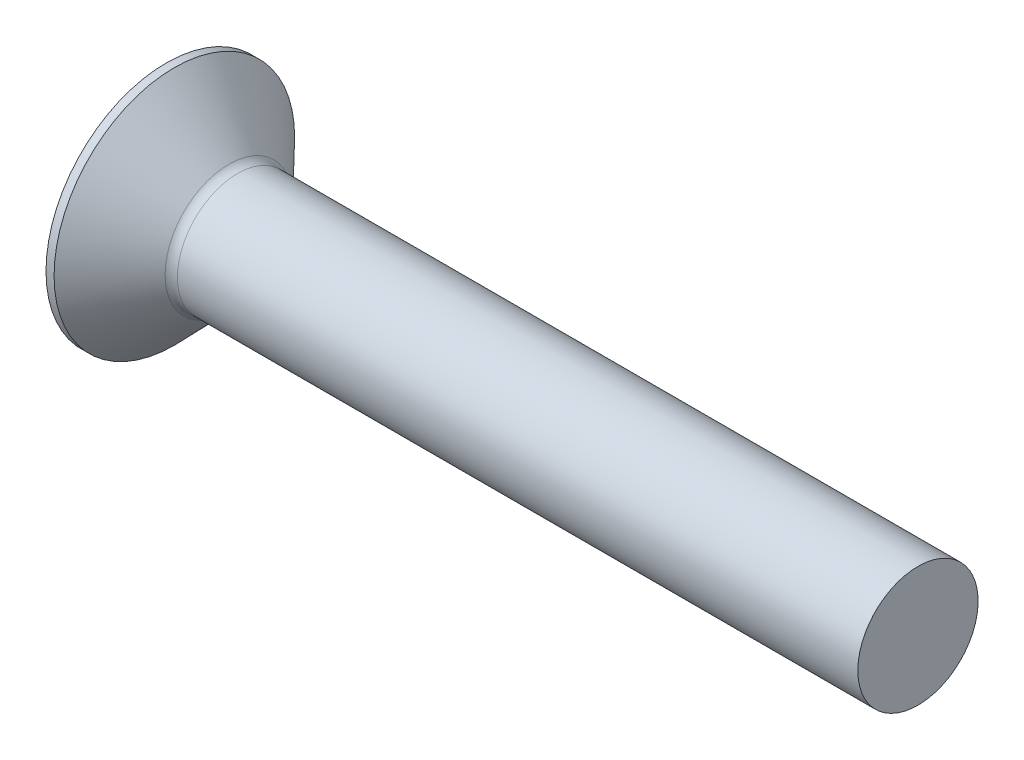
ISO-10303-21;
HEADER;
FILE_DESCRIPTION(('STEP AP214'),'2;1');
FILE_NAME('part.step','',(''),(''),'','','');
FILE_SCHEMA(('AUTOMOTIVE_DESIGN { 1 0 10303 214 1 1 1 1 }'));
ENDSEC;
DATA;
#1=APPLICATION_CONTEXT('core data for automotive mechanical design processes');
#2=APPLICATION_PROTOCOL_DEFINITION('international standard','automotive_design',2000,#1);
#3=PRODUCT_CONTEXT('',#1,'mechanical');
#4=PRODUCT('Part','Part','',(#3));
#5=PRODUCT_RELATED_PRODUCT_CATEGORY('part','',(#4));
#6=PRODUCT_DEFINITION_FORMATION('','',#4);
#7=PRODUCT_DEFINITION_CONTEXT('part definition',#1,'design');
#8=PRODUCT_DEFINITION('design','',#6,#7);
#9=PRODUCT_DEFINITION_SHAPE('','',#8);
#10=(LENGTH_UNIT() NAMED_UNIT(*) SI_UNIT(.MILLI.,.METRE.));
#11=(NAMED_UNIT(*) PLANE_ANGLE_UNIT() SI_UNIT($,.RADIAN.));
#12=(NAMED_UNIT(*) SI_UNIT($,.STERADIAN.) SOLID_ANGLE_UNIT());
#13=UNCERTAINTY_MEASURE_WITH_UNIT(LENGTH_MEASURE(1.E-05),#10,'distance_accuracy_value','');
#14=(GEOMETRIC_REPRESENTATION_CONTEXT(3) GLOBAL_UNCERTAINTY_ASSIGNED_CONTEXT((#13)) GLOBAL_UNIT_ASSIGNED_CONTEXT((#10,
#11,#12)) REPRESENTATION_CONTEXT('',''));
#15=CARTESIAN_POINT('',(0.,0.,0.));
#16=DIRECTION('',(0.,0.,1.));
#17=DIRECTION('',(1.,0.,0.));
#18=AXIS2_PLACEMENT_3D('',#15,#16,#17);
#19=CARTESIAN_POINT('',(18.6777777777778,0.,0.));
#20=DIRECTION('',(-1.,0.,0.));
#21=DIRECTION('',(0.,1.,0.));
#22=AXIS2_PLACEMENT_3D('',#19,#20,#21);
#23=SPHERICAL_SURFACE('',#22,18.6777777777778);
#24=CARTESIAN_POINT('',(1.8,0.,0.));
#25=DIRECTION('',(-1.,0.,0.));
#26=DIRECTION('',(0.,0.,1.));
#27=AXIS2_PLACEMENT_3D('',#24,#25,#26);
#28=CIRCLE('',#27,8.);
#29=CARTESIAN_POINT('',(1.8,0.,8.));
#30=VERTEX_POINT('',#29);
#31=EDGE_CURVE('E703',#30,#30,#28,.T.);
#32=ORIENTED_EDGE('',*,*,#31,.T.);
#33=EDGE_LOOP('',(#32));
#34=FACE_BOUND('',#33,.T.);
#35=CARTESIAN_POINT('',(0.115409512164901,0.,0.));
#36=DIRECTION('',(1.,0.,0.));
#37=DIRECTION('',(0.,0.,-1.));
#38=AXIS2_PLACEMENT_3D('',#35,#36,#37);
#39=CIRCLE('',#38,2.07312978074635);
#40=CARTESIAN_POINT('',(0.115409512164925,-0.945999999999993,-1.84470894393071));
#41=VERTEX_POINT('',#40);
#42=CARTESIAN_POINT('',(0.115409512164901,-1.84470894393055,-0.945999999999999));
#43=VERTEX_POINT('',#42);
#44=EDGE_CURVE('E486',#41,#43,#39,.F.);
#45=ORIENTED_EDGE('',*,*,#44,.F.);
#46=CARTESIAN_POINT('',(18.6777777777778,-0.946,0.));
#47=DIRECTION('',(0.,1.,0.));
#48=DIRECTION('',(0.,0.,1.));
#49=AXIS2_PLACEMENT_3D('',#46,#47,#48);
#50=CIRCLE('',#49,18.6538056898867);
#51=CARTESIAN_POINT('',(0.472183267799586,-0.945999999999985,-4.06457811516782));
#52=VERTEX_POINT('',#51);
#53=EDGE_CURVE('E677',#52,#41,#50,.T.);
#54=ORIENTED_EDGE('',*,*,#53,.F.);
#55=CARTESIAN_POINT('',(16.6762390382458,0.,4.01446578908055));
#56=DIRECTION('',(-0.446197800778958,0.,0.894934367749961));
#57=DIRECTION('',(0.89493436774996,0.,0.446197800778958));
#58=AXIS2_PLACEMENT_3D('',#55,#56,#57);
#59=CIRCLE('',#58,18.1311138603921);
#60=CARTESIAN_POINT('',(0.472183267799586,0.946000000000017,-4.06457811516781));
#61=VERTEX_POINT('',#60);
#62=EDGE_CURVE('E61',#61,#52,#59,.T.);
#63=ORIENTED_EDGE('',*,*,#62,.F.);
#64=CARTESIAN_POINT('',(18.6777777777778,0.945999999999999,0.));
#65=DIRECTION('',(0.,-1.,0.));
#66=DIRECTION('',(0.,0.,-1.));
#67=AXIS2_PLACEMENT_3D('',#64,#65,#66);
#68=CIRCLE('',#67,18.6538056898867);
#69=CARTESIAN_POINT('',(0.115409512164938,0.946000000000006,-1.8447089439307));
#70=VERTEX_POINT('',#69);
#71=EDGE_CURVE('E589',#70,#61,#68,.T.);
#72=ORIENTED_EDGE('',*,*,#71,.F.);
#73=CARTESIAN_POINT('',(0.115409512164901,1.84470894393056,-0.945999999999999));
#74=VERTEX_POINT('',#73);
#75=EDGE_CURVE('E733',#74,#70,#39,.F.);
#76=ORIENTED_EDGE('',*,*,#75,.F.);
#77=CARTESIAN_POINT('',(18.6777777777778,0.,-0.945999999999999));
#78=DIRECTION('',(0.,0.,1.));
#79=DIRECTION('',(1.,0.,0.));
#80=AXIS2_PLACEMENT_3D('',#77,#78,#79);
#81=CIRCLE('',#80,18.6538056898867);
#82=CARTESIAN_POINT('',(0.472183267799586,4.06457811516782,-0.945999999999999));
#83=VERTEX_POINT('',#82);
#84=EDGE_CURVE('E714',#83,#74,#81,.T.);
#85=ORIENTED_EDGE('',*,*,#84,.F.);
#86=CARTESIAN_POINT('',(16.6762390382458,-4.01446578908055,0.));
#87=DIRECTION('',(-0.446197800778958,-0.89493436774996,0.));
#88=DIRECTION('',(0.89493436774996,-0.446197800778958,0.));
#89=AXIS2_PLACEMENT_3D('',#86,#87,#88);
#90=CIRCLE('',#89,18.1311138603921);
#91=CARTESIAN_POINT('',(0.472183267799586,4.06457811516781,0.946));
#92=VERTEX_POINT('',#91);
#93=EDGE_CURVE('E711',#92,#83,#90,.T.);
#94=ORIENTED_EDGE('',*,*,#93,.F.);
#95=CARTESIAN_POINT('',(18.6777777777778,0.,0.946));
#96=DIRECTION('',(0.,0.,-1.));
#97=DIRECTION('',(0.,1.,0.));
#98=AXIS2_PLACEMENT_3D('',#95,#96,#97);
#99=CIRCLE('',#98,18.6538056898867);
#100=CARTESIAN_POINT('',(0.115409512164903,1.84470894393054,0.946));
#101=VERTEX_POINT('',#100);
#102=EDGE_CURVE('E77',#101,#92,#99,.T.);
#103=ORIENTED_EDGE('',*,*,#102,.F.);
#104=CARTESIAN_POINT('',(0.11540951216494,0.945999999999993,1.84470894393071));
#105=VERTEX_POINT('',#104);
#106=EDGE_CURVE('E485',#105,#101,#39,.F.);
#107=ORIENTED_EDGE('',*,*,#106,.F.);
#108=CARTESIAN_POINT('',(0.472183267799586,0.945999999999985,4.06457811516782));
#109=VERTEX_POINT('',#108);
#110=EDGE_CURVE('E681',#109,#105,#68,.T.);
#111=ORIENTED_EDGE('',*,*,#110,.F.);
#112=CARTESIAN_POINT('',(16.6762390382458,0.,-4.01446578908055));
#113=DIRECTION('',(-0.446197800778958,0.,-0.89493436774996));
#114=DIRECTION('',(-0.89493436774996,0.,0.446197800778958));
#115=AXIS2_PLACEMENT_3D('',#112,#113,#114);
#116=CIRCLE('',#115,18.1311138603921);
#117=CARTESIAN_POINT('',(0.472183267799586,-0.946000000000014,4.06457811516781));
#118=VERTEX_POINT('',#117);
#119=EDGE_CURVE('E673',#118,#109,#116,.T.);
#120=ORIENTED_EDGE('',*,*,#119,.F.);
#121=CARTESIAN_POINT('',(0.115409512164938,-0.946000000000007,1.8447089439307));
#122=VERTEX_POINT('',#121);
#123=EDGE_CURVE('E680',#122,#118,#50,.T.);
#124=ORIENTED_EDGE('',*,*,#123,.F.);
#125=CARTESIAN_POINT('',(0.115409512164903,-1.84470894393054,0.946));
#126=VERTEX_POINT('',#125);
#127=EDGE_CURVE('E480',#126,#122,#39,.F.);
#128=ORIENTED_EDGE('',*,*,#127,.F.);
#129=CARTESIAN_POINT('',(0.472183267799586,-4.06457811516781,0.945999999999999));
#130=VERTEX_POINT('',#129);
#131=EDGE_CURVE('E717',#130,#126,#99,.T.);
#132=ORIENTED_EDGE('',*,*,#131,.F.);
#133=CARTESIAN_POINT('',(16.6762390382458,4.01446578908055,0.));
#134=DIRECTION('',(-0.446197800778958,0.894934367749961,0.));
#135=DIRECTION('',(-0.89493436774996,-0.446197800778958,0.));
#136=AXIS2_PLACEMENT_3D('',#133,#134,#135);
#137=CIRCLE('',#136,18.1311138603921);
#138=CARTESIAN_POINT('',(0.472183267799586,-4.06457811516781,-0.946000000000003));
#139=VERTEX_POINT('',#138);
#140=EDGE_CURVE('E719',#139,#130,#137,.T.);
#141=ORIENTED_EDGE('',*,*,#140,.F.);
#142=EDGE_CURVE('E713',#43,#139,#81,.T.);
#143=ORIENTED_EDGE('',*,*,#142,.F.);
#144=EDGE_LOOP('',(#45,#54,#63,#72,#76,#85,#94,#103,#107,#111,#120,#124,#128,#132,#141,#143));
#145=FACE_BOUND('',#144,.T.);
#146=ADVANCED_FACE('F51',(#34,#145),#23,.T.);
#147=CARTESIAN_POINT('',(0.,-4.29999999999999,0.945999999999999));
#148=DIRECTION('',(0.,0.,-1.));
#149=DIRECTION('',(0.,1.,0.));
#150=AXIS2_PLACEMENT_3D('',#147,#148,#149);
#151=PLANE('',#150);
#152=ORIENTED_EDGE('',*,*,#131,.T.);
#153=CARTESIAN_POINT('',(0.0477500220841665,-1.8500244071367,0.946));
#154=CARTESIAN_POINT('',(0.693218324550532,-1.79930842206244,0.946));
#155=CARTESIAN_POINT('',(1.33865688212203,-1.74820388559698,0.946));
#156=CARTESIAN_POINT('',(2.62944221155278,-1.64487236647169,0.946));
#157=CARTESIAN_POINT('',(3.27478898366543,-1.59264538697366,0.946));
#158=CARTESIAN_POINT('',(4.13011009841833,-1.52244607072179,0.946));
#159=CARTESIAN_POINT('',(4.34013828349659,-1.50513000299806,0.946));
#160=CARTESIAN_POINT('',(4.76018035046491,-1.4703229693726,0.946));
#161=CARTESIAN_POINT('',(4.97019423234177,-1.45283200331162,0.946));
#162=CARTESIAN_POINT('',(5.1802,-1.43524392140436,0.946));
#163=B_SPLINE_CURVE_WITH_KNOTS('',3,(#153,#154,#155,#156,#157,#158,#159,#160,#161,#162),
.UNSPECIFIED.,.F.,.F.,(4,2,2,2,4),(0.,1.94237417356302,3.88474287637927,4.51696520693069,
5.14918811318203),.UNSPECIFIED.);
#164=CARTESIAN_POINT('',(5.18,-1.43526067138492,0.946));
#165=VERTEX_POINT('',#164);
#166=EDGE_CURVE('E478',#126,#165,#163,.T.);
#167=ORIENTED_EDGE('',*,*,#166,.T.);
#168=DIRECTION('',(0.,-1.,0.));
#169=VECTOR('',#168,1.);
#170=CARTESIAN_POINT('',(5.18,1.7173473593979,0.946));
#171=LINE('',#170,#169);
#172=CARTESIAN_POINT('',(5.18,-1.7173473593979,0.946));
#173=VERTEX_POINT('',#172);
#174=EDGE_CURVE('E430',#165,#173,#171,.T.);
#175=ORIENTED_EDGE('',*,*,#174,.T.);
#176=DIRECTION('',(0.89493436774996,0.446197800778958,0.));
#177=VECTOR('',#176,1.);
#178=CARTESIAN_POINT('',(0.,-4.3,0.945999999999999));
#179=LINE('',#178,#177);
#180=EDGE_CURVE('E693',#130,#173,#179,.T.);
#181=ORIENTED_EDGE('',*,*,#180,.F.);
#182=EDGE_LOOP('',(#152,#167,#175,#181));
#183=FACE_BOUND('',#182,.T.);
#184=ADVANCED_FACE('F208',(#183),#151,.T.);
#185=CARTESIAN_POINT('',(5.18,1.7173473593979,0.946));
#186=VERTEX_POINT('',#185);
#187=CARTESIAN_POINT('',(5.18,1.43526067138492,0.946));
#188=VERTEX_POINT('',#187);
#189=EDGE_CURVE('E445',#186,#188,#171,.T.);
#190=ORIENTED_EDGE('',*,*,#189,.T.);
#191=CARTESIAN_POINT('',(5.1802,1.43524392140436,0.946));
#192=CARTESIAN_POINT('',(4.6464401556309,1.47993054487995,0.946));
#193=CARTESIAN_POINT('',(4.11263086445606,1.52402131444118,0.946));
#194=CARTESIAN_POINT('',(3.04493385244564,1.61123082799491,0.946));
#195=CARTESIAN_POINT('',(2.51104613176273,1.65434957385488,0.946));
#196=CARTESIAN_POINT('',(1.65558557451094,1.72283326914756,0.946));
#197=CARTESIAN_POINT('',(1.33403186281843,1.74843790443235,0.946));
#198=CARTESIAN_POINT('',(0.690904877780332,1.79940507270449,0.946));
#199=CARTESIAN_POINT('',(0.369331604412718,1.82476760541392,0.946));
#200=CARTESIAN_POINT('',(0.0477500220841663,1.8500244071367,0.946));
#201=B_SPLINE_CURVE_WITH_KNOTS('',3,(#191,#192,#193,#194,#195,#196,#197,#198,#199,#200),
.UNSPECIFIED.,.F.,.F.,(4,2,2,2,4),(0.,1.60688056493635,3.21375804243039,4.18147254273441,
5.14918815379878),.UNSPECIFIED.);
#202=EDGE_CURVE('E740',#188,#101,#201,.T.);
#203=ORIENTED_EDGE('',*,*,#202,.T.);
#204=ORIENTED_EDGE('',*,*,#102,.T.);
#205=DIRECTION('',(0.89493436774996,-0.446197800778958,0.));
#206=VECTOR('',#205,1.);
#207=CARTESIAN_POINT('',(0.,4.3,0.946));
#208=LINE('',#207,#206);
#209=EDGE_CURVE('E691',#92,#186,#208,.T.);
#210=ORIENTED_EDGE('',*,*,#209,.T.);
#211=EDGE_LOOP('',(#190,#203,#204,#210));
#212=FACE_BOUND('',#211,.T.);
#213=ADVANCED_FACE('F213',(#212),#151,.T.);
#214=CARTESIAN_POINT('',(5.18,1.7173473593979,-0.945999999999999));
#215=DIRECTION('',(0.,0.,1.));
#216=DIRECTION('',(1.,0.,0.));
#217=AXIS2_PLACEMENT_3D('',#214,#215,#216);
#218=PLANE('',#217);
#219=DIRECTION('',(0.,1.,0.));
#220=VECTOR('',#219,1.);
#221=CARTESIAN_POINT('',(5.18,1.7173473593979,-0.945999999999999));
#222=LINE('',#221,#220);
#223=CARTESIAN_POINT('',(5.18,-1.7173473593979,-0.945999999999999));
#224=VERTEX_POINT('',#223);
#225=CARTESIAN_POINT('',(5.18,-1.43526067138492,-0.945999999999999));
#226=VERTEX_POINT('',#225);
#227=EDGE_CURVE('E627',#224,#226,#222,.T.);
#228=ORIENTED_EDGE('',*,*,#227,.T.);
#229=CARTESIAN_POINT('',(5.1802,-1.43524392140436,-0.945999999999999));
#230=CARTESIAN_POINT('',(4.6464401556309,-1.47993054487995,-0.945999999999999));
#231=CARTESIAN_POINT('',(4.11263086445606,-1.52402131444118,-0.945999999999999));
#232=CARTESIAN_POINT('',(3.04493385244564,-1.61123082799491,-0.945999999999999));
#233=CARTESIAN_POINT('',(2.51104613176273,-1.65434957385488,-0.945999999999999));
#234=CARTESIAN_POINT('',(1.65558557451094,-1.72283326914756,-0.945999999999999));
#235=CARTESIAN_POINT('',(1.33403186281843,-1.74843790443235,-0.945999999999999));
#236=CARTESIAN_POINT('',(0.690904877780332,-1.79940507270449,-0.945999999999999));
#237=CARTESIAN_POINT('',(0.369331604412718,-1.82476760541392,-0.945999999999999));
#238=CARTESIAN_POINT('',(0.0477500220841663,-1.8500244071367,-0.945999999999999));
#239=B_SPLINE_CURVE_WITH_KNOTS('',3,(#229,#230,#231,#232,#233,#234,#235,#236,#237,#238),
.UNSPECIFIED.,.F.,.F.,(4,2,2,2,4),(0.,1.60688056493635,3.21375804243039,4.18147254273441,
5.14918815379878),.UNSPECIFIED.);
#240=EDGE_CURVE('E506',#226,#43,#239,.T.);
#241=ORIENTED_EDGE('',*,*,#240,.T.);
#242=ORIENTED_EDGE('',*,*,#142,.T.);
#243=DIRECTION('',(0.89493436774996,0.446197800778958,0.));
#244=VECTOR('',#243,1.);
#245=CARTESIAN_POINT('',(0.,-4.3,-0.946));
#246=LINE('',#245,#244);
#247=EDGE_CURVE('E690',#139,#224,#246,.T.);
#248=ORIENTED_EDGE('',*,*,#247,.T.);
#249=EDGE_LOOP('',(#228,#241,#242,#248));
#250=FACE_BOUND('',#249,.T.);
#251=ADVANCED_FACE('F516',(#250),#218,.T.);
#252=ORIENTED_EDGE('',*,*,#84,.T.);
#253=CARTESIAN_POINT('',(0.0477500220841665,1.8500244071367,-0.945999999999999));
#254=CARTESIAN_POINT('',(0.693218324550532,1.79930842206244,-0.945999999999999));
#255=CARTESIAN_POINT('',(1.33865688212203,1.74820388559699,-0.945999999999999));
#256=CARTESIAN_POINT('',(2.62944221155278,1.64487236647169,-0.945999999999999));
#257=CARTESIAN_POINT('',(3.27478898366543,1.59264538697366,-0.945999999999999));
#258=CARTESIAN_POINT('',(4.13011009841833,1.52244607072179,-0.945999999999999));
#259=CARTESIAN_POINT('',(4.34013828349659,1.50513000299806,-0.945999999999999));
#260=CARTESIAN_POINT('',(4.76018035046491,1.4703229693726,-0.945999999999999));
#261=CARTESIAN_POINT('',(4.97019423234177,1.45283200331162,-0.945999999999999));
#262=CARTESIAN_POINT('',(5.1802,1.43524392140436,-0.945999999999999));
#263=B_SPLINE_CURVE_WITH_KNOTS('',3,(#253,#254,#255,#256,#257,#258,#259,#260,#261,#262),
.UNSPECIFIED.,.F.,.F.,(4,2,2,2,4),(0.,1.94237417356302,3.88474287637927,4.51696520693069,
5.14918811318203),.UNSPECIFIED.);
#264=CARTESIAN_POINT('',(5.18,1.43526067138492,-0.946));
#265=VERTEX_POINT('',#264);
#266=EDGE_CURVE('E531',#74,#265,#263,.T.);
#267=ORIENTED_EDGE('',*,*,#266,.T.);
#268=CARTESIAN_POINT('',(5.18,1.7173473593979,-0.945999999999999));
#269=VERTEX_POINT('',#268);
#270=EDGE_CURVE('E629',#265,#269,#222,.T.);
#271=ORIENTED_EDGE('',*,*,#270,.T.);
#272=DIRECTION('',(0.89493436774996,-0.446197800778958,0.));
#273=VECTOR('',#272,1.);
#274=CARTESIAN_POINT('',(0.,4.3,-0.945999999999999));
#275=LINE('',#274,#273);
#276=EDGE_CURVE('E687',#83,#269,#275,.T.);
#277=ORIENTED_EDGE('',*,*,#276,.F.);
#278=EDGE_LOOP('',(#252,#267,#271,#277));
#279=FACE_BOUND('',#278,.T.);
#280=ADVANCED_FACE('F396',(#279),#218,.T.);
#281=CARTESIAN_POINT('',(5.18,-1.7173473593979,-0.945999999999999));
#282=DIRECTION('',(-0.446197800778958,0.894934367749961,0.));
#283=DIRECTION('',(-0.89493436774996,-0.446197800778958,0.));
#284=AXIS2_PLACEMENT_3D('',#281,#282,#283);
#285=PLANE('',#284);
#286=DIRECTION('',(0.,0.,-1.));
#287=VECTOR('',#286,1.);
#288=CARTESIAN_POINT('',(5.18,-1.7173473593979,0.946));
#289=LINE('',#288,#287);
#290=CARTESIAN_POINT('',(5.18,-1.7173473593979,0.0748815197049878));
#291=VERTEX_POINT('',#290);
#292=EDGE_CURVE('E637',#173,#291,#289,.T.);
#293=ORIENTED_EDGE('',*,*,#292,.T.);
#294=CARTESIAN_POINT('',(5.18,0.,0.));
#295=DIRECTION('',(-1.,0.,0.));
#296=DIRECTION('',(0.,-0.999050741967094,-0.0435616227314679));
#297=AXIS2_PLACEMENT_3D('',#294,#295,#296);
#298=CIRCLE('',#297,1.71897911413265);
#299=CARTESIAN_POINT('',(5.18,-1.71734735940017,-0.0748815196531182));
#300=VERTEX_POINT('',#299);
#301=EDGE_CURVE('E378',#300,#291,#298,.T.);
#302=ORIENTED_EDGE('',*,*,#301,.F.);
#303=EDGE_CURVE('E418',#300,#224,#289,.T.);
#304=ORIENTED_EDGE('',*,*,#303,.T.);
#305=ORIENTED_EDGE('',*,*,#247,.F.);
#306=ORIENTED_EDGE('',*,*,#140,.T.);
#307=ORIENTED_EDGE('',*,*,#180,.T.);
#308=EDGE_LOOP('',(#293,#302,#304,#305,#306,#307));
#309=FACE_BOUND('',#308,.T.);
#310=ADVANCED_FACE('F387',(#309),#285,.T.);
#311=CARTESIAN_POINT('',(5.18,1.7173473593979,0.946));
#312=DIRECTION('',(-0.446197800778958,-0.89493436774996,0.));
#313=DIRECTION('',(0.89493436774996,-0.446197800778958,0.));
#314=AXIS2_PLACEMENT_3D('',#311,#312,#313);
#315=PLANE('',#314);
#316=DIRECTION('',(0.,0.,1.));
#317=VECTOR('',#316,1.);
#318=CARTESIAN_POINT('',(5.18,1.7173473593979,0.946));
#319=LINE('',#318,#317);
#320=CARTESIAN_POINT('',(5.18,1.7173473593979,-0.0748815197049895));
#321=VERTEX_POINT('',#320);
#322=EDGE_CURVE('E638',#269,#321,#319,.T.);
#323=ORIENTED_EDGE('',*,*,#322,.T.);
#324=CARTESIAN_POINT('',(5.18,0.,0.));
#325=DIRECTION('',(-1.,0.,0.));
#326=DIRECTION('',(0.,0.999050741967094,0.0435616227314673));
#327=AXIS2_PLACEMENT_3D('',#324,#325,#326);
#328=CIRCLE('',#327,1.71897911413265);
#329=CARTESIAN_POINT('',(5.18,1.71734735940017,0.0748815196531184));
#330=VERTEX_POINT('',#329);
#331=EDGE_CURVE('E364',#330,#321,#328,.T.);
#332=ORIENTED_EDGE('',*,*,#331,.F.);
#333=EDGE_CURVE('E457',#330,#186,#319,.T.);
#334=ORIENTED_EDGE('',*,*,#333,.T.);
#335=ORIENTED_EDGE('',*,*,#209,.F.);
#336=ORIENTED_EDGE('',*,*,#93,.T.);
#337=ORIENTED_EDGE('',*,*,#276,.T.);
#338=EDGE_LOOP('',(#323,#332,#334,#335,#336,#337));
#339=FACE_BOUND('',#338,.T.);
#340=ADVANCED_FACE('F241',(#339),#315,.T.);
#341=CARTESIAN_POINT('',(5.18,1.7173473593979,0.946));
#342=DIRECTION('',(1.,0.,0.));
#343=DIRECTION('',(0.,0.,-1.));
#344=AXIS2_PLACEMENT_3D('',#341,#342,#343);
#345=PLANE('',#344);
#346=CARTESIAN_POINT('',(5.18,0.,0.));
#347=DIRECTION('',(-1.,0.,0.));
#348=DIRECTION('',(0.,0.,1.));
#349=AXIS2_PLACEMENT_3D('',#346,#347,#348);
#350=CIRCLE('',#349,1.71897911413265);
#351=CARTESIAN_POINT('',(5.18,-0.074881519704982,-1.7173473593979));
#352=VERTEX_POINT('',#351);
#353=CARTESIAN_POINT('',(5.18,-0.945999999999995,-1.43526067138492));
#354=VERTEX_POINT('',#353);
#355=EDGE_CURVE('E765',#352,#354,#350,.T.);
#356=ORIENTED_EDGE('',*,*,#355,.F.);
#357=DIRECTION('',(0.,1.,0.));
#358=VECTOR('',#357,1.);
#359=CARTESIAN_POINT('',(5.18,-0.945999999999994,-1.71734735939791));
#360=LINE('',#359,#358);
#361=CARTESIAN_POINT('',(5.18,-0.945999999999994,-1.71734735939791));
#362=VERTEX_POINT('',#361);
#363=EDGE_CURVE('E617',#362,#352,#360,.T.);
#364=ORIENTED_EDGE('',*,*,#363,.F.);
#365=DIRECTION('',(0.,0.,-1.));
#366=VECTOR('',#365,1.);
#367=CARTESIAN_POINT('',(5.18,-0.946000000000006,1.7173473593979));
#368=LINE('',#367,#366);
#369=EDGE_CURVE('E615',#354,#362,#368,.T.);
#370=ORIENTED_EDGE('',*,*,#369,.F.);
#371=EDGE_LOOP('',(#356,#364,#370));
#372=FACE_BOUND('',#371,.T.);
#373=ADVANCED_FACE('F236',(#372),#345,.F.);
#374=EDGE_CURVE('E771',#226,#300,#350,.T.);
#375=ORIENTED_EDGE('',*,*,#374,.F.);
#376=ORIENTED_EDGE('',*,*,#227,.F.);
#377=ORIENTED_EDGE('',*,*,#303,.F.);
#378=EDGE_LOOP('',(#375,#376,#377));
#379=FACE_BOUND('',#378,.T.);
#380=ADVANCED_FACE('F240',(#379),#345,.F.);
#381=EDGE_CURVE('E773',#291,#165,#350,.T.);
#382=ORIENTED_EDGE('',*,*,#381,.F.);
#383=ORIENTED_EDGE('',*,*,#292,.F.);
#384=ORIENTED_EDGE('',*,*,#174,.F.);
#385=EDGE_LOOP('',(#382,#383,#384));
#386=FACE_BOUND('',#385,.T.);
#387=ADVANCED_FACE('F780',(#386),#345,.F.);
#388=CARTESIAN_POINT('',(5.18,-0.946000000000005,1.43526067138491));
#389=VERTEX_POINT('',#388);
#390=CARTESIAN_POINT('',(5.18,-0.0748815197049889,1.7173473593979));
#391=VERTEX_POINT('',#390);
#392=EDGE_CURVE('E777',#389,#391,#350,.T.);
#393=ORIENTED_EDGE('',*,*,#392,.F.);
#394=CARTESIAN_POINT('',(5.18,-0.946000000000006,1.7173473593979));
#395=VERTEX_POINT('',#394);
#396=EDGE_CURVE('E605',#395,#389,#368,.T.);
#397=ORIENTED_EDGE('',*,*,#396,.F.);
#398=DIRECTION('',(0.,-1.,0.));
#399=VECTOR('',#398,1.);
#400=CARTESIAN_POINT('',(5.18,-0.946000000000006,1.7173473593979));
#401=LINE('',#400,#399);
#402=EDGE_CURVE('E311',#391,#395,#401,.T.);
#403=ORIENTED_EDGE('',*,*,#402,.F.);
#404=EDGE_LOOP('',(#393,#397,#403));
#405=FACE_BOUND('',#404,.T.);
#406=ADVANCED_FACE('F778',(#405),#345,.F.);
#407=CARTESIAN_POINT('',(5.18,0.0748815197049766,1.7173473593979));
#408=VERTEX_POINT('',#407);
#409=CARTESIAN_POINT('',(5.18,0.945999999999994,1.43526067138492));
#410=VERTEX_POINT('',#409);
#411=EDGE_CURVE('E69',#408,#410,#350,.T.);
#412=ORIENTED_EDGE('',*,*,#411,.F.);
#413=CARTESIAN_POINT('',(5.18,0.945999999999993,1.71734735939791));
#414=VERTEX_POINT('',#413);
#415=EDGE_CURVE('E55',#414,#408,#401,.T.);
#416=ORIENTED_EDGE('',*,*,#415,.F.);
#417=DIRECTION('',(0.,0.,1.));
#418=VECTOR('',#417,1.);
#419=CARTESIAN_POINT('',(5.18,0.945999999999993,1.71734735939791));
#420=LINE('',#419,#418);
#421=EDGE_CURVE('E384',#410,#414,#420,.T.);
#422=ORIENTED_EDGE('',*,*,#421,.F.);
#423=EDGE_LOOP('',(#412,#416,#422));
#424=FACE_BOUND('',#423,.T.);
#425=ADVANCED_FACE('F674',(#424),#345,.F.);
#426=EDGE_CURVE('E744',#188,#330,#350,.T.);
#427=ORIENTED_EDGE('',*,*,#426,.F.);
#428=ORIENTED_EDGE('',*,*,#189,.F.);
#429=ORIENTED_EDGE('',*,*,#333,.F.);
#430=EDGE_LOOP('',(#427,#428,#429));
#431=FACE_BOUND('',#430,.T.);
#432=ADVANCED_FACE('F785',(#431),#345,.F.);
#433=EDGE_CURVE('E756',#321,#265,#350,.T.);
#434=ORIENTED_EDGE('',*,*,#433,.F.);
#435=ORIENTED_EDGE('',*,*,#322,.F.);
#436=ORIENTED_EDGE('',*,*,#270,.F.);
#437=EDGE_LOOP('',(#434,#435,#436));
#438=FACE_BOUND('',#437,.T.);
#439=ADVANCED_FACE('F819',(#438),#345,.F.);
#440=CARTESIAN_POINT('',(5.18,0.946000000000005,-1.43526067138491));
#441=VERTEX_POINT('',#440);
#442=CARTESIAN_POINT('',(5.18,0.0748815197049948,-1.7173473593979));
#443=VERTEX_POINT('',#442);
#444=EDGE_CURVE('E762',#441,#443,#350,.T.);
#445=ORIENTED_EDGE('',*,*,#444,.F.);
#446=CARTESIAN_POINT('',(5.18,0.946000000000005,-1.7173473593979));
#447=VERTEX_POINT('',#446);
#448=EDGE_CURVE('E640',#447,#441,#420,.T.);
#449=ORIENTED_EDGE('',*,*,#448,.F.);
#450=EDGE_CURVE('E320',#443,#447,#360,.T.);
#451=ORIENTED_EDGE('',*,*,#450,.F.);
#452=EDGE_LOOP('',(#445,#449,#451));
#453=FACE_BOUND('',#452,.T.);
#454=ADVANCED_FACE('F243',(#453),#345,.F.);
#455=CARTESIAN_POINT('',(5.18,0.945999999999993,1.71734735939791));
#456=DIRECTION('',(0.,-1.,0.));
#457=DIRECTION('',(1.,0.,0.));
#458=AXIS2_PLACEMENT_3D('',#455,#456,#457);
#459=PLANE('',#458);
#460=ORIENTED_EDGE('',*,*,#448,.T.);
#461=CARTESIAN_POINT('',(5.1802,0.946000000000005,-1.43524392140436));
#462=CARTESIAN_POINT('',(4.6464401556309,0.946000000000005,-1.47993054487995));
#463=CARTESIAN_POINT('',(4.11263086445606,0.946000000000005,-1.52402131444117));
#464=CARTESIAN_POINT('',(3.04493385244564,0.946000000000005,-1.6112308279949));
#465=CARTESIAN_POINT('',(2.51104613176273,0.946000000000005,-1.65434957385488));
#466=CARTESIAN_POINT('',(1.65558557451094,0.946000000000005,-1.72283326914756));
#467=CARTESIAN_POINT('',(1.33403186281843,0.946000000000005,-1.74843790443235));
#468=CARTESIAN_POINT('',(0.690904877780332,0.946000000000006,-1.79940507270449));
#469=CARTESIAN_POINT('',(0.369331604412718,0.946000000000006,-1.82476760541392));
#470=CARTESIAN_POINT('',(0.0477500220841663,0.946000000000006,-1.8500244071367));
#471=B_SPLINE_CURVE_WITH_KNOTS('',3,(#461,#462,#463,#464,#465,#466,#467,#468,#469,#470),
.UNSPECIFIED.,.F.,.F.,(4,2,2,2,4),(0.,1.60688056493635,3.21375804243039,4.18147254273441,
5.14918815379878),.UNSPECIFIED.);
#472=EDGE_CURVE('E509',#441,#70,#471,.T.);
#473=ORIENTED_EDGE('',*,*,#472,.T.);
#474=ORIENTED_EDGE('',*,*,#71,.T.);
#475=DIRECTION('',(0.89493436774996,0.,0.446197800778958));
#476=VECTOR('',#475,1.);
#477=CARTESIAN_POINT('',(0.,0.946000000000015,-4.3));
#478=LINE('',#477,#476);
#479=EDGE_CURVE('E582',#61,#447,#478,.T.);
#480=ORIENTED_EDGE('',*,*,#479,.T.);
#481=EDGE_LOOP('',(#460,#473,#474,#480));
#482=FACE_BOUND('',#481,.T.);
#483=ADVANCED_FACE('F645',(#482),#459,.T.);
#484=CARTESIAN_POINT('',(0.,-0.945999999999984,-4.3));
#485=DIRECTION('',(0.,1.,0.));
#486=DIRECTION('',(0.,0.,1.));
#487=AXIS2_PLACEMENT_3D('',#484,#485,#486);
#488=PLANE('',#487);
#489=ORIENTED_EDGE('',*,*,#53,.T.);
#490=CARTESIAN_POINT('',(0.0477500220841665,-0.945999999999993,-1.85002440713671));
#491=CARTESIAN_POINT('',(0.693218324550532,-0.945999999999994,-1.79930842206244));
#492=CARTESIAN_POINT('',(1.33865688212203,-0.945999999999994,-1.74820388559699));
#493=CARTESIAN_POINT('',(2.62944221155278,-0.945999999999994,-1.64487236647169));
#494=CARTESIAN_POINT('',(3.27478898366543,-0.945999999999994,-1.59264538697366));
#495=CARTESIAN_POINT('',(4.13011009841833,-0.945999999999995,-1.5224460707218));
#496=CARTESIAN_POINT('',(4.34013828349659,-0.945999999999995,-1.50513000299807));
#497=CARTESIAN_POINT('',(4.76018035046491,-0.945999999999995,-1.4703229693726));
#498=CARTESIAN_POINT('',(4.97019423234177,-0.945999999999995,-1.45283200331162));
#499=CARTESIAN_POINT('',(5.1802,-0.945999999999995,-1.43524392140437));
#500=B_SPLINE_CURVE_WITH_KNOTS('',3,(#490,#491,#492,#493,#494,#495,#496,#497,#498,#499),
.UNSPECIFIED.,.F.,.F.,(4,2,2,2,4),(0.,1.94237417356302,3.88474287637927,4.51696520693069,
5.14918811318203),.UNSPECIFIED.);
#501=EDGE_CURVE('E479',#41,#354,#500,.T.);
#502=ORIENTED_EDGE('',*,*,#501,.T.);
#503=ORIENTED_EDGE('',*,*,#369,.T.);
#504=DIRECTION('',(0.89493436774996,0.,0.446197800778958));
#505=VECTOR('',#504,1.);
#506=CARTESIAN_POINT('',(0.,-0.945999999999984,-4.3));
#507=LINE('',#506,#505);
#508=EDGE_CURVE('E588',#52,#362,#507,.T.);
#509=ORIENTED_EDGE('',*,*,#508,.F.);
#510=EDGE_LOOP('',(#489,#502,#503,#509));
#511=FACE_BOUND('',#510,.T.);
#512=ADVANCED_FACE('F344',(#511),#488,.T.);
#513=CARTESIAN_POINT('',(5.18,0.946000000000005,-1.7173473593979));
#514=DIRECTION('',(-0.446197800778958,0.,0.894934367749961));
#515=DIRECTION('',(-0.89493436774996,0.,-0.446197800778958));
#516=AXIS2_PLACEMENT_3D('',#513,#514,#515);
#517=PLANE('',#516);
#518=ORIENTED_EDGE('',*,*,#363,.T.);
#519=CARTESIAN_POINT('',(5.18,0.,0.));
#520=DIRECTION('',(-1.,0.,0.));
#521=DIRECTION('',(0.,0.0435616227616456,-0.999050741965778));
#522=AXIS2_PLACEMENT_3D('',#519,#520,#521);
#523=CIRCLE('',#522,1.71897911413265);
#524=EDGE_CURVE('E477',#443,#352,#523,.T.);
#525=ORIENTED_EDGE('',*,*,#524,.F.);
#526=ORIENTED_EDGE('',*,*,#450,.T.);
#527=ORIENTED_EDGE('',*,*,#479,.F.);
#528=ORIENTED_EDGE('',*,*,#62,.T.);
#529=ORIENTED_EDGE('',*,*,#508,.T.);
#530=EDGE_LOOP('',(#518,#525,#526,#527,#528,#529));
#531=FACE_BOUND('',#530,.T.);
#532=ADVANCED_FACE('F334',(#531),#517,.T.);
#533=CARTESIAN_POINT('',(5.18,-0.946000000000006,1.7173473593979));
#534=DIRECTION('',(-0.446197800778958,0.,-0.89493436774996));
#535=DIRECTION('',(0.89493436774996,0.,-0.446197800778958));
#536=AXIS2_PLACEMENT_3D('',#533,#534,#535);
#537=PLANE('',#536);
#538=ORIENTED_EDGE('',*,*,#415,.T.);
#539=CARTESIAN_POINT('',(5.18,0.,0.));
#540=DIRECTION('',(-1.,0.,0.));
#541=DIRECTION('',(0.,-0.0435616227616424,0.999050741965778));
#542=AXIS2_PLACEMENT_3D('',#539,#540,#541);
#543=CIRCLE('',#542,1.71897911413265);
#544=EDGE_CURVE('E464',#391,#408,#543,.T.);
#545=ORIENTED_EDGE('',*,*,#544,.F.);
#546=ORIENTED_EDGE('',*,*,#402,.T.);
#547=DIRECTION('',(0.89493436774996,0.,-0.446197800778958));
#548=VECTOR('',#547,1.);
#549=CARTESIAN_POINT('',(0.,-0.946000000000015,4.3));
#550=LINE('',#549,#548);
#551=EDGE_CURVE('E583',#118,#395,#550,.T.);
#552=ORIENTED_EDGE('',*,*,#551,.F.);
#553=ORIENTED_EDGE('',*,*,#119,.T.);
#554=DIRECTION('',(0.89493436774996,0.,-0.446197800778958));
#555=VECTOR('',#554,1.);
#556=CARTESIAN_POINT('',(0.,0.945999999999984,4.3));
#557=LINE('',#556,#555);
#558=EDGE_CURVE('E579',#109,#414,#557,.T.);
#559=ORIENTED_EDGE('',*,*,#558,.T.);
#560=EDGE_LOOP('',(#538,#545,#546,#552,#553,#559));
#561=FACE_BOUND('',#560,.T.);
#562=ADVANCED_FACE('F343',(#561),#537,.T.);
#563=ORIENTED_EDGE('',*,*,#396,.T.);
#564=CARTESIAN_POINT('',(5.1802,-0.946000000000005,1.43524392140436));
#565=CARTESIAN_POINT('',(4.6464401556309,-0.946000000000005,1.47993054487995));
#566=CARTESIAN_POINT('',(4.11263086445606,-0.946000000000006,1.52402131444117));
#567=CARTESIAN_POINT('',(3.04493385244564,-0.946000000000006,1.6112308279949));
#568=CARTESIAN_POINT('',(2.51104613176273,-0.946000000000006,1.65434957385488));
#569=CARTESIAN_POINT('',(1.65558557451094,-0.946000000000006,1.72283326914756));
#570=CARTESIAN_POINT('',(1.33403186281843,-0.946000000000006,1.74843790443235));
#571=CARTESIAN_POINT('',(0.690904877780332,-0.946000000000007,1.79940507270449));
#572=CARTESIAN_POINT('',(0.369331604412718,-0.946000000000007,1.82476760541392));
#573=CARTESIAN_POINT('',(0.0477500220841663,-0.946000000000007,1.8500244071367));
#574=B_SPLINE_CURVE_WITH_KNOTS('',3,(#564,#565,#566,#567,#568,#569,#570,#571,#572,#573),
.UNSPECIFIED.,.F.,.F.,(4,2,2,2,4),(0.,1.60688056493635,3.21375804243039,4.18147254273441,
5.14918815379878),.UNSPECIFIED.);
#575=EDGE_CURVE('E483',#389,#122,#574,.T.);
#576=ORIENTED_EDGE('',*,*,#575,.T.);
#577=ORIENTED_EDGE('',*,*,#123,.T.);
#578=ORIENTED_EDGE('',*,*,#551,.T.);
#579=EDGE_LOOP('',(#563,#576,#577,#578));
#580=FACE_BOUND('',#579,.T.);
#581=ADVANCED_FACE('F613',(#580),#488,.T.);
#582=ORIENTED_EDGE('',*,*,#110,.T.);
#583=CARTESIAN_POINT('',(0.0477500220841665,0.945999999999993,1.85002440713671));
#584=CARTESIAN_POINT('',(0.693218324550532,0.945999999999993,1.79930842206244));
#585=CARTESIAN_POINT('',(1.33865688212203,0.945999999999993,1.74820388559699));
#586=CARTESIAN_POINT('',(2.62944221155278,0.945999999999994,1.6448723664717));
#587=CARTESIAN_POINT('',(3.27478898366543,0.945999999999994,1.59264538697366));
#588=CARTESIAN_POINT('',(4.13011009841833,0.945999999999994,1.5224460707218));
#589=CARTESIAN_POINT('',(4.34013828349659,0.945999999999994,1.50513000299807));
#590=CARTESIAN_POINT('',(4.76018035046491,0.945999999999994,1.4703229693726));
#591=CARTESIAN_POINT('',(4.97019423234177,0.945999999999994,1.45283200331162));
#592=CARTESIAN_POINT('',(5.1802,0.945999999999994,1.43524392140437));
#593=B_SPLINE_CURVE_WITH_KNOTS('',3,(#583,#584,#585,#586,#587,#588,#589,#590,#591,#592),
.UNSPECIFIED.,.F.,.F.,(4,2,2,2,4),(0.,1.94237417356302,3.88474287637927,4.51696520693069,
5.14918811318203),.UNSPECIFIED.);
#594=EDGE_CURVE('E12',#105,#410,#593,.T.);
#595=ORIENTED_EDGE('',*,*,#594,.T.);
#596=ORIENTED_EDGE('',*,*,#421,.T.);
#597=ORIENTED_EDGE('',*,*,#558,.F.);
#598=EDGE_LOOP('',(#582,#595,#596,#597));
#599=FACE_BOUND('',#598,.T.);
#600=ADVANCED_FACE('F223',(#599),#459,.T.);
#601=CARTESIAN_POINT('',(1.8,0.,0.));
#602=DIRECTION('',(-1.,0.,0.));
#603=DIRECTION('',(0.,0.,1.));
#604=AXIS2_PLACEMENT_3D('',#601,#602,#603);
#605=CYLINDRICAL_SURFACE('',#604,8.);
#606=ORIENTED_EDGE('',*,*,#31,.F.);
#607=EDGE_LOOP('',(#606));
#608=FACE_BOUND('',#607,.T.);
#609=CARTESIAN_POINT('',(2.33724490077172,0.,0.));
#610=DIRECTION('',(-1.,0.,0.));
#611=DIRECTION('',(0.,0.,1.));
#612=AXIS2_PLACEMENT_3D('',#609,#610,#611);
#613=CIRCLE('',#612,8.);
#614=CARTESIAN_POINT('',(2.33724490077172,0.,8.));
#615=VERTEX_POINT('',#614);
#616=EDGE_CURVE('E700',#615,#615,#613,.T.);
#617=ORIENTED_EDGE('',*,*,#616,.T.);
#618=EDGE_LOOP('',(#617));
#619=FACE_BOUND('',#618,.T.);
#620=ADVANCED_FACE('F219',(#608,#619),#605,.T.);
#621=CARTESIAN_POINT('',(6.2,0.,0.));
#622=DIRECTION('',(-1.,0.,0.));
#623=DIRECTION('',(0.,0.,1.));
#624=AXIS2_PLACEMENT_3D('',#621,#622,#623);
#625=CONICAL_SURFACE('',#624,4.,0.802851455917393);
#626=CARTESIAN_POINT('',(5.96410801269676,0.,0.));
#627=DIRECTION('',(-1.,0.,0.));
#628=DIRECTION('',(0.,0.,1.));
#629=AXIS2_PLACEMENT_3D('',#626,#627,#628);
#630=CIRCLE('',#629,4.2442733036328);
#631=CARTESIAN_POINT('',(5.96410801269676,0.,4.2442733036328));
#632=VERTEX_POINT('',#631);
#633=EDGE_CURVE('E705',#632,#632,#630,.T.);
#634=ORIENTED_EDGE('',*,*,#633,.T.);
#635=EDGE_LOOP('',(#634));
#636=FACE_BOUND('',#635,.T.);
#637=ORIENTED_EDGE('',*,*,#616,.F.);
#638=EDGE_LOOP('',(#637));
#639=FACE_BOUND('',#638,.T.);
#640=ADVANCED_FACE('F222',(#636,#639),#625,.T.);
#641=CARTESIAN_POINT('',(1.8,0.,0.));
#642=DIRECTION('',(-1.,0.,0.));
#643=DIRECTION('',(0.,0.,1.));
#644=AXIS2_PLACEMENT_3D('',#641,#642,#643);
#645=CYLINDRICAL_SURFACE('',#644,4.);
#646=CARTESIAN_POINT('',(6.53957985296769,0.,0.));
#647=DIRECTION('',(-1.,0.,0.));
#648=DIRECTION('',(0.,0.,1.));
#649=AXIS2_PLACEMENT_3D('',#646,#647,#648);
#650=CIRCLE('',#649,4.);
#651=CARTESIAN_POINT('',(6.53957985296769,0.,4.));
#652=VERTEX_POINT('',#651);
#653=EDGE_CURVE('E708',#652,#652,#650,.F.);
#654=ORIENTED_EDGE('',*,*,#653,.T.);
#655=EDGE_LOOP('',(#654));
#656=FACE_BOUND('',#655,.T.);
#657=CARTESIAN_POINT('',(51.8,0.,0.));
#658=DIRECTION('',(-1.,0.,0.));
#659=DIRECTION('',(0.,0.,1.));
#660=AXIS2_PLACEMENT_3D('',#657,#658,#659);
#661=CIRCLE('',#660,4.);
#662=CARTESIAN_POINT('',(51.8,0.,4.));
#663=VERTEX_POINT('',#662);
#664=EDGE_CURVE('E697',#663,#663,#661,.T.);
#665=ORIENTED_EDGE('',*,*,#664,.T.);
#666=EDGE_LOOP('',(#665));
#667=FACE_BOUND('',#666,.T.);
#668=ADVANCED_FACE('F227',(#656,#667),#645,.T.);
#669=CARTESIAN_POINT('',(51.8,4.,0.));
#670=DIRECTION('',(-1.,0.,0.));
#671=DIRECTION('',(0.,0.,1.));
#672=AXIS2_PLACEMENT_3D('',#669,#670,#671);
#673=PLANE('',#672);
#674=ORIENTED_EDGE('',*,*,#664,.F.);
#675=EDGE_LOOP('',(#674));
#676=FACE_BOUND('',#675,.T.);
#677=ADVANCED_FACE('F231',(#676),#673,.F.);
#678=CARTESIAN_POINT('',(6.53957985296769,0.,0.));
#679=DIRECTION('',(-1.,0.,0.));
#680=DIRECTION('',(0.,0.,1.));
#681=AXIS2_PLACEMENT_3D('',#678,#679,#680);
#682=TOROIDAL_SURFACE('',#681,4.8,0.8);
#683=ORIENTED_EDGE('',*,*,#653,.F.);
#684=EDGE_LOOP('',(#683));
#685=FACE_BOUND('',#684,.T.);
#686=ORIENTED_EDGE('',*,*,#633,.F.);
#687=EDGE_LOOP('',(#686));
#688=FACE_BOUND('',#687,.T.);
#689=ADVANCED_FACE('F53',(#685,#688),#682,.F.);
#690=CARTESIAN_POINT('',(5.18,0.,0.));
#691=DIRECTION('',(-1.,0.,0.));
#692=DIRECTION('',(0.,0.,1.));
#693=AXIS2_PLACEMENT_3D('',#690,#691,#692);
#694=CONICAL_SURFACE('',#693,1.71897911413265,0.069813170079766);
#695=ORIENTED_EDGE('',*,*,#75,.T.);
#696=ORIENTED_EDGE('',*,*,#472,.F.);
#697=EDGE_CURVE('E759',#265,#441,#350,.T.);
#698=ORIENTED_EDGE('',*,*,#697,.F.);
#699=ORIENTED_EDGE('',*,*,#266,.F.);
#700=EDGE_LOOP('',(#695,#696,#698,#699));
#701=FACE_BOUND('',#700,.T.);
#702=ADVANCED_FACE('F205',(#701),#694,.F.);
#703=EDGE_CURVE('E768',#354,#226,#350,.T.);
#704=ORIENTED_EDGE('',*,*,#703,.F.);
#705=ORIENTED_EDGE('',*,*,#501,.F.);
#706=ORIENTED_EDGE('',*,*,#44,.T.);
#707=ORIENTED_EDGE('',*,*,#240,.F.);
#708=EDGE_LOOP('',(#704,#705,#706,#707));
#709=FACE_BOUND('',#708,.T.);
#710=ADVANCED_FACE('F804',(#709),#694,.F.);
#711=ORIENTED_EDGE('',*,*,#127,.T.);
#712=ORIENTED_EDGE('',*,*,#575,.F.);
#713=EDGE_CURVE('E775',#165,#389,#350,.T.);
#714=ORIENTED_EDGE('',*,*,#713,.F.);
#715=ORIENTED_EDGE('',*,*,#166,.F.);
#716=EDGE_LOOP('',(#711,#712,#714,#715));
#717=FACE_BOUND('',#716,.T.);
#718=ADVANCED_FACE('F202',(#717),#694,.F.);
#719=EDGE_CURVE('E742',#410,#188,#350,.T.);
#720=ORIENTED_EDGE('',*,*,#719,.F.);
#721=ORIENTED_EDGE('',*,*,#594,.F.);
#722=ORIENTED_EDGE('',*,*,#106,.T.);
#723=ORIENTED_EDGE('',*,*,#202,.F.);
#724=EDGE_LOOP('',(#720,#721,#722,#723));
#725=FACE_BOUND('',#724,.T.);
#726=ADVANCED_FACE('F197',(#725),#694,.F.);
#727=CARTESIAN_POINT('',(5.73853017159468,0.,0.));
#728=DIRECTION('',(-1.,0.,0.));
#729=DIRECTION('',(0.,0.,1.));
#730=AXIS2_PLACEMENT_3D('',#727,#728,#729);
#731=CONICAL_SURFACE('',#730,0.,1.25663706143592);
#732=ORIENTED_EDGE('',*,*,#411,.T.);
#733=ORIENTED_EDGE('',*,*,#719,.T.);
#734=ORIENTED_EDGE('',*,*,#426,.T.);
#735=ORIENTED_EDGE('',*,*,#331,.T.);
#736=ORIENTED_EDGE('',*,*,#433,.T.);
#737=ORIENTED_EDGE('',*,*,#697,.T.);
#738=ORIENTED_EDGE('',*,*,#444,.T.);
#739=ORIENTED_EDGE('',*,*,#524,.T.);
#740=ORIENTED_EDGE('',*,*,#355,.T.);
#741=ORIENTED_EDGE('',*,*,#703,.T.);
#742=ORIENTED_EDGE('',*,*,#374,.T.);
#743=ORIENTED_EDGE('',*,*,#301,.T.);
#744=ORIENTED_EDGE('',*,*,#381,.T.);
#745=ORIENTED_EDGE('',*,*,#713,.T.);
#746=ORIENTED_EDGE('',*,*,#392,.T.);
#747=ORIENTED_EDGE('',*,*,#544,.T.);
#748=EDGE_LOOP('',(#732,#733,#734,#735,#736,#737,#738,#739,#740,#741,#742,#743,#744,#745,#746,#747));
#749=FACE_BOUND('',#748,.T.);
#750=CARTESIAN_POINT('',(5.73853017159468,0.,0.));
#751=VERTEX_POINT('',#750);
#752=VERTEX_LOOP('',#751);
#753=FACE_BOUND('',#752,.T.);
#754=ADVANCED_FACE('F195',(#749,#753),#731,.F.);
#755=CLOSED_SHELL('',(#146,#184,#213,#251,#280,#310,#340,#373,#380,#387,#406,#425,#432,#439,
#454,#483,#512,#532,#562,#581,#600,#620,#640,#668,#677,#689,#702,#710,#718,#726,#754));
#756=MANIFOLD_SOLID_BREP('B2',#755);
#757=ADVANCED_BREP_SHAPE_REPRESENTATION('',(#18,#756),#14);
#758=SHAPE_DEFINITION_REPRESENTATION(#9,#757);
ENDSEC;
END-ISO-10303-21;
